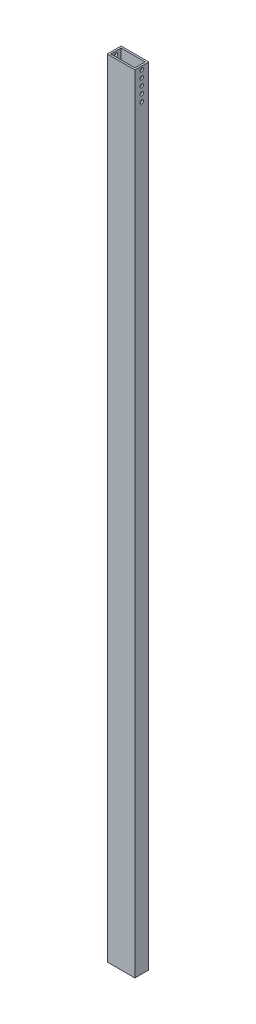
from build123d import *

# Parameters (mm, degrees)
SKETCH1_W           = 50.8
SKETCH1_H           = 25.4
SKETCH1_W_2         = 44.45
SKETCH1_H_2         = 19.05
BOSS_EXTRUDE1_DEPTH = 1447.8
SKETCH2_R           = 3.175
CUT_EXTRUDE1_DEPTH  = 1449.746620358
LPATTERN1_COUNT     = 5
LPATTERN1_PITCH     = 12.7
CUT_EXTRUDE2_REACH  = 1450.246
SKETCH3_R           = 3.175


with BuildPart() as part:
    # Sketch1 → Boss-Extrude1 (new body)
    with BuildSketch(Plane(origin=(0, 0, 0), x_dir=(1, 0, 0), z_dir=(0, 1, 0))):
        Rectangle(SKETCH1_W, SKETCH1_H)
        Rectangle(SKETCH1_W_2, SKETCH1_H_2, mode=Mode.SUBTRACT)
    extrude(amount=BOSS_EXTRUDE1_DEPTH)

    # Sketch2 → Cut-Extrude1 (cut, through all)
    with BuildSketch(Plane(origin=(25.4, 0, 0), x_dir=(0, 0, -1), z_dir=(1, 0, 0))):
        with Locations((0, 1441.45)):
            Circle(SKETCH2_R)
    cut_extrude1 = extrude(amount=-CUT_EXTRUDE1_DEPTH, mode=Mode.SUBTRACT)

    # LPattern1: Cut-Extrude1 ×5
    with Locations(*[(0, -i * LPATTERN1_PITCH, 0) for i in range(1, LPATTERN1_COUNT)]):
        add(cut_extrude1, mode=Mode.SUBTRACT)

    # Sketch3 → Cut-Extrude2 (cut, up to next)
    with BuildSketch(Plane(origin=(0, 0, -12.7), x_dir=(-1, 0, 0), z_dir=(0, 0, -1)), mode=Mode.PRIVATE) as cut_extrude2_sk1:
        with Locations((-13.151855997, 758.831280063)):
            Circle(SKETCH3_R)
    cut_extrude2_tool1 = extrude(cut_extrude2_sk1.sketch, amount=-CUT_EXTRUDE2_REACH, mode=Mode.PRIVATE) & part.part
    # Sketch3 → Cut-Extrude2 (cut, up to next)
    with BuildSketch(Plane(origin=(0, 0, -12.7), x_dir=(-1, 0, 0), z_dir=(0, 0, -1)), mode=Mode.PRIVATE) as cut_extrude2_sk2:
        with Locations((-13.151855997, 746.131280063)):
            Circle(SKETCH3_R)
    cut_extrude2_tool2 = extrude(cut_extrude2_sk2.sketch, amount=-CUT_EXTRUDE2_REACH, mode=Mode.PRIVATE) & part.part
    # Sketch3 → Cut-Extrude2 (cut, up to next)
    with BuildSketch(Plane(origin=(0, 0, -12.7), x_dir=(-1, 0, 0), z_dir=(0, 0, -1)), mode=Mode.PRIVATE) as cut_extrude2_sk3:
        with Locations((-13.151855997, 733.431280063)):
            Circle(SKETCH3_R)
    cut_extrude2_tool3 = extrude(cut_extrude2_sk3.sketch, amount=-CUT_EXTRUDE2_REACH, mode=Mode.PRIVATE) & part.part
    # Sketch3 → Cut-Extrude2 (cut, up to next)
    with BuildSketch(Plane(origin=(0, 0, -12.7), x_dir=(-1, 0, 0), z_dir=(0, 0, -1)), mode=Mode.PRIVATE) as cut_extrude2_sk4:
        with Locations((-13.151855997, 720.731280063)):
            Circle(SKETCH3_R)
    cut_extrude2_tool4 = extrude(cut_extrude2_sk4.sketch, amount=-CUT_EXTRUDE2_REACH, mode=Mode.PRIVATE) & part.part
    # Sketch3 → Cut-Extrude2 (cut, up to next)
    with BuildSketch(Plane(origin=(0, 0, -12.7), x_dir=(-1, 0, 0), z_dir=(0, 0, -1)), mode=Mode.PRIVATE) as cut_extrude2_sk5:
        with Locations((-13.151855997, 708.031280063)):
            Circle(SKETCH3_R)
    cut_extrude2_tool5 = extrude(cut_extrude2_sk5.sketch, amount=-CUT_EXTRUDE2_REACH, mode=Mode.PRIVATE) & part.part
    add(cut_extrude2_tool1.solids().sort_by_distance((13.151856, 758.83128, -12.7))[0], mode=Mode.SUBTRACT)
    add(cut_extrude2_tool2.solids().sort_by_distance((13.151856, 746.13128, -12.7))[0], mode=Mode.SUBTRACT)
    add(cut_extrude2_tool3.solids().sort_by_distance((13.151856, 733.43128, -12.7))[0], mode=Mode.SUBTRACT)
    add(cut_extrude2_tool4.solids().sort_by_distance((13.151856, 720.73128, -12.7))[0], mode=Mode.SUBTRACT)
    add(cut_extrude2_tool5.solids().sort_by_distance((13.151856, 708.03128, -12.7))[0], mode=Mode.SUBTRACT)


solid = part.part
